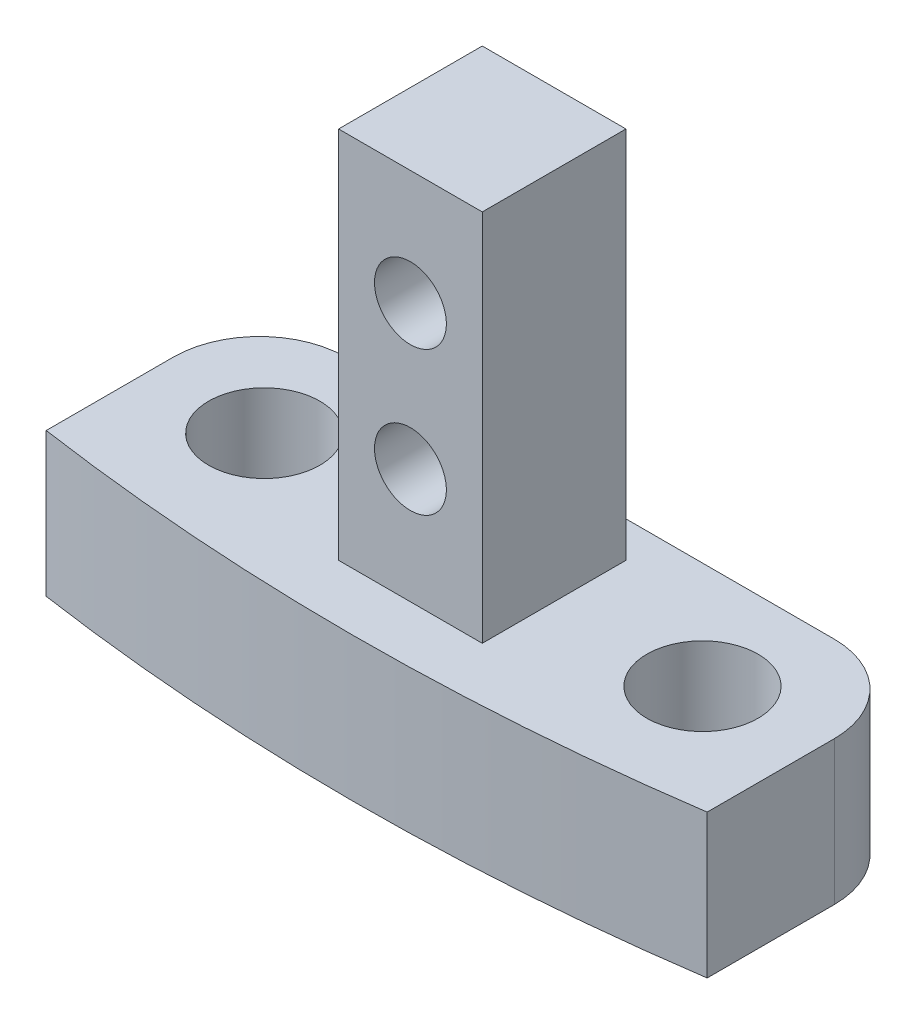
ISO-10303-21;
HEADER;
FILE_DESCRIPTION(('STEP AP214'),'2;1');
FILE_NAME('part.step','',(''),(''),'','','');
FILE_SCHEMA(('AUTOMOTIVE_DESIGN { 1 0 10303 214 1 1 1 1 }'));
ENDSEC;
DATA;
#1=APPLICATION_CONTEXT('core data for automotive mechanical design processes');
#2=APPLICATION_PROTOCOL_DEFINITION('international standard','automotive_design',2000,#1);
#3=PRODUCT_CONTEXT('',#1,'mechanical');
#4=PRODUCT('Part','Part','',(#3));
#5=PRODUCT_RELATED_PRODUCT_CATEGORY('part','',(#4));
#6=PRODUCT_DEFINITION_FORMATION('','',#4);
#7=PRODUCT_DEFINITION_CONTEXT('part definition',#1,'design');
#8=PRODUCT_DEFINITION('design','',#6,#7);
#9=PRODUCT_DEFINITION_SHAPE('','',#8);
#10=(LENGTH_UNIT() NAMED_UNIT(*) SI_UNIT(.MILLI.,.METRE.));
#11=(NAMED_UNIT(*) PLANE_ANGLE_UNIT() SI_UNIT($,.RADIAN.));
#12=(NAMED_UNIT(*) SI_UNIT($,.STERADIAN.) SOLID_ANGLE_UNIT());
#13=UNCERTAINTY_MEASURE_WITH_UNIT(LENGTH_MEASURE(1.E-05),#10,'distance_accuracy_value','');
#14=(GEOMETRIC_REPRESENTATION_CONTEXT(3) GLOBAL_UNCERTAINTY_ASSIGNED_CONTEXT((#13)) GLOBAL_UNIT_ASSIGNED_CONTEXT((#10,
#11,#12)) REPRESENTATION_CONTEXT('',''));
#15=CARTESIAN_POINT('',(0.,0.,0.));
#16=DIRECTION('',(0.,0.,1.));
#17=DIRECTION('',(1.,0.,0.));
#18=AXIS2_PLACEMENT_3D('',#15,#16,#17);
#19=CARTESIAN_POINT('',(0.,6.35,-79.1345216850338));
#20=DIRECTION('',(0.,-1.,0.));
#21=DIRECTION('',(0.,0.,-1.));
#22=AXIS2_PLACEMENT_3D('',#19,#20,#21);
#23=PLANE('',#22);
#24=CARTESIAN_POINT('',(9.68375,6.35,16.0671853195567));
#25=DIRECTION('',(0.,1.,0.));
#26=DIRECTION('',(0.,0.,1.));
#27=AXIS2_PLACEMENT_3D('',#24,#25,#26);
#28=CIRCLE('',#27,2.45744999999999);
#29=CARTESIAN_POINT('',(9.68375,6.35,18.5246353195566));
#30=VERTEX_POINT('',#29);
#31=EDGE_CURVE('E171',#30,#30,#28,.T.);
#32=ORIENTED_EDGE('',*,*,#31,.F.);
#33=EDGE_LOOP('',(#32));
#34=FACE_BOUND('',#33,.T.);
#35=CARTESIAN_POINT('',(-9.68375,6.35,16.0671853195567));
#36=DIRECTION('',(0.,1.,0.));
#37=DIRECTION('',(0.,0.,1.));
#38=AXIS2_PLACEMENT_3D('',#35,#36,#37);
#39=CIRCLE('',#38,2.45744999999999);
#40=CARTESIAN_POINT('',(-9.68375,6.35,18.5246353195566));
#41=VERTEX_POINT('',#40);
#42=EDGE_CURVE('E370',#41,#41,#39,.T.);
#43=ORIENTED_EDGE('',*,*,#42,.F.);
#44=EDGE_LOOP('',(#43));
#45=FACE_BOUND('',#44,.T.);
#46=DIRECTION('',(-1.,0.,0.));
#47=VECTOR('',#46,1.);
#48=CARTESIAN_POINT('',(-14.605,6.35,11.3529783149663));
#49=LINE('',#48,#47);
#50=CARTESIAN_POINT('',(10.795,6.35,11.3529783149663));
#51=VERTEX_POINT('',#50);
#52=CARTESIAN_POINT('',(-10.795,6.35,11.3529783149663));
#53=VERTEX_POINT('',#52);
#54=EDGE_CURVE('E153',#51,#53,#49,.T.);
#55=ORIENTED_EDGE('',*,*,#54,.T.);
#56=CARTESIAN_POINT('',(-10.795,6.35,15.1629783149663));
#57=DIRECTION('',(0.,-1.,0.));
#58=DIRECTION('',(0.,0.,-1.));
#59=AXIS2_PLACEMENT_3D('',#56,#57,#58);
#60=CIRCLE('',#59,3.81);
#61=CARTESIAN_POINT('',(-14.605,6.35,15.1629783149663));
#62=VERTEX_POINT('',#61);
#63=EDGE_CURVE('E43',#53,#62,#60,.F.);
#64=ORIENTED_EDGE('',*,*,#63,.T.);
#65=DIRECTION('',(0.,0.,1.));
#66=VECTOR('',#65,1.);
#67=CARTESIAN_POINT('',(-14.605,6.35,20.781392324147));
#68=LINE('',#67,#66);
#69=CARTESIAN_POINT('',(-14.605,6.35,20.781392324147));
#70=VERTEX_POINT('',#69);
#71=EDGE_CURVE('E155',#62,#70,#68,.T.);
#72=ORIENTED_EDGE('',*,*,#71,.T.);
#73=CARTESIAN_POINT('',(0.,6.35,-79.1345216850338));
#74=DIRECTION('',(0.,1.,0.));
#75=DIRECTION('',(0.,0.,-1.));
#76=AXIS2_PLACEMENT_3D('',#73,#74,#75);
#77=CIRCLE('',#76,100.9777);
#78=CARTESIAN_POINT('',(14.605,6.35,20.781392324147));
#79=VERTEX_POINT('',#78);
#80=EDGE_CURVE('E147',#70,#79,#77,.T.);
#81=ORIENTED_EDGE('',*,*,#80,.T.);
#82=DIRECTION('',(0.,0.,-1.));
#83=VECTOR('',#82,1.);
#84=CARTESIAN_POINT('',(14.605,6.35,11.3529783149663));
#85=LINE('',#84,#83);
#86=CARTESIAN_POINT('',(14.605,6.35,15.1629783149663));
#87=VERTEX_POINT('',#86);
#88=EDGE_CURVE('E150',#79,#87,#85,.T.);
#89=ORIENTED_EDGE('',*,*,#88,.T.);
#90=CARTESIAN_POINT('',(10.795,6.35,15.1629783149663));
#91=DIRECTION('',(0.,-1.,0.));
#92=DIRECTION('',(0.,0.,-1.));
#93=AXIS2_PLACEMENT_3D('',#90,#91,#92);
#94=CIRCLE('',#93,3.81);
#95=EDGE_CURVE('E187',#87,#51,#94,.F.);
#96=ORIENTED_EDGE('',*,*,#95,.T.);
#97=EDGE_LOOP('',(#55,#64,#72,#81,#89,#96));
#98=FACE_BOUND('',#97,.T.);
#99=DIRECTION('',(0.,0.,-1.));
#100=VECTOR('',#99,1.);
#101=CARTESIAN_POINT('',(3.175,6.35,19.2904783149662));
#102=LINE('',#101,#100);
#103=CARTESIAN_POINT('',(3.175,6.35,19.2904783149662));
#104=VERTEX_POINT('',#103);
#105=CARTESIAN_POINT('',(3.175,6.35,12.9404783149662));
#106=VERTEX_POINT('',#105);
#107=EDGE_CURVE('E137',#104,#106,#102,.T.);
#108=ORIENTED_EDGE('',*,*,#107,.F.);
#109=DIRECTION('',(1.,0.,0.));
#110=VECTOR('',#109,1.);
#111=CARTESIAN_POINT('',(-3.175,6.35,19.2904783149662));
#112=LINE('',#111,#110);
#113=CARTESIAN_POINT('',(-3.175,6.35,19.2904783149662));
#114=VERTEX_POINT('',#113);
#115=EDGE_CURVE('E134',#114,#104,#112,.T.);
#116=ORIENTED_EDGE('',*,*,#115,.F.);
#117=DIRECTION('',(0.,0.,1.));
#118=VECTOR('',#117,1.);
#119=CARTESIAN_POINT('',(-3.175,6.35,19.2904783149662));
#120=LINE('',#119,#118);
#121=CARTESIAN_POINT('',(-3.175,6.35,12.9404783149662));
#122=VERTEX_POINT('',#121);
#123=EDGE_CURVE('E382',#122,#114,#120,.T.);
#124=ORIENTED_EDGE('',*,*,#123,.F.);
#125=DIRECTION('',(-1.,0.,0.));
#126=VECTOR('',#125,1.);
#127=CARTESIAN_POINT('',(-3.175,6.35,12.9404783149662));
#128=LINE('',#127,#126);
#129=EDGE_CURVE('E372',#106,#122,#128,.T.);
#130=ORIENTED_EDGE('',*,*,#129,.F.);
#131=EDGE_LOOP('',(#108,#116,#124,#130));
#132=FACE_BOUND('',#131,.T.);
#133=ADVANCED_FACE('F35',(#34,#45,#98,#132),#23,.F.);
#134=CARTESIAN_POINT('',(0.,6.35,-79.1345216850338));
#135=DIRECTION('',(0.,-1.,0.));
#136=DIRECTION('',(0.,0.,-1.));
#137=AXIS2_PLACEMENT_3D('',#134,#135,#136);
#138=CYLINDRICAL_SURFACE('',#137,100.9777);
#139=CARTESIAN_POINT('',(0.,0.,-79.1345216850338));
#140=DIRECTION('',(0.,1.,0.));
#141=DIRECTION('',(0.,0.,-1.));
#142=AXIS2_PLACEMENT_3D('',#139,#140,#141);
#143=CIRCLE('',#142,100.9777);
#144=CARTESIAN_POINT('',(-14.605,0.,20.781392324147));
#145=VERTEX_POINT('',#144);
#146=CARTESIAN_POINT('',(14.605,0.,20.781392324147));
#147=VERTEX_POINT('',#146);
#148=EDGE_CURVE('E138',#145,#147,#143,.T.);
#149=ORIENTED_EDGE('',*,*,#148,.T.);
#150=DIRECTION('',(0.,-1.,0.));
#151=VECTOR('',#150,1.);
#152=CARTESIAN_POINT('',(14.605,6.35,20.781392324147));
#153=LINE('',#152,#151);
#154=EDGE_CURVE('E164',#79,#147,#153,.T.);
#155=ORIENTED_EDGE('',*,*,#154,.F.);
#156=ORIENTED_EDGE('',*,*,#80,.F.);
#157=DIRECTION('',(0.,-1.,0.));
#158=VECTOR('',#157,1.);
#159=CARTESIAN_POINT('',(-14.605,6.35,20.781392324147));
#160=LINE('',#159,#158);
#161=EDGE_CURVE('E156',#70,#145,#160,.T.);
#162=ORIENTED_EDGE('',*,*,#161,.T.);
#163=EDGE_LOOP('',(#149,#155,#156,#162));
#164=FACE_BOUND('',#163,.T.);
#165=ADVANCED_FACE('F211',(#164),#138,.T.);
#166=CARTESIAN_POINT('',(14.605,6.35,11.3529783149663));
#167=DIRECTION('',(-1.,0.,0.));
#168=DIRECTION('',(0.,0.,1.));
#169=AXIS2_PLACEMENT_3D('',#166,#167,#168);
#170=PLANE('',#169);
#171=DIRECTION('',(0.,0.,-1.));
#172=VECTOR('',#171,1.);
#173=CARTESIAN_POINT('',(14.605,0.,11.3529783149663));
#174=LINE('',#173,#172);
#175=CARTESIAN_POINT('',(14.605,0.,15.1629783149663));
#176=VERTEX_POINT('',#175);
#177=EDGE_CURVE('E141',#147,#176,#174,.T.);
#178=ORIENTED_EDGE('',*,*,#177,.T.);
#179=DIRECTION('',(0.,-1.,0.));
#180=VECTOR('',#179,1.);
#181=CARTESIAN_POINT('',(14.605,6.35,15.1629783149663));
#182=LINE('',#181,#180);
#183=EDGE_CURVE('E11',#176,#87,#182,.F.);
#184=ORIENTED_EDGE('',*,*,#183,.T.);
#185=ORIENTED_EDGE('',*,*,#88,.F.);
#186=ORIENTED_EDGE('',*,*,#154,.T.);
#187=EDGE_LOOP('',(#178,#184,#185,#186));
#188=FACE_BOUND('',#187,.T.);
#189=ADVANCED_FACE('F208',(#188),#170,.F.);
#190=CARTESIAN_POINT('',(-14.605,6.35,11.3529783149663));
#191=DIRECTION('',(0.,0.,1.));
#192=DIRECTION('',(1.,0.,0.));
#193=AXIS2_PLACEMENT_3D('',#190,#191,#192);
#194=PLANE('',#193);
#195=DIRECTION('',(-1.,0.,0.));
#196=VECTOR('',#195,1.);
#197=CARTESIAN_POINT('',(-14.605,0.,11.3529783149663));
#198=LINE('',#197,#196);
#199=CARTESIAN_POINT('',(10.795,0.,11.3529783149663));
#200=VERTEX_POINT('',#199);
#201=CARTESIAN_POINT('',(-10.795,0.,11.3529783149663));
#202=VERTEX_POINT('',#201);
#203=EDGE_CURVE('E159',#200,#202,#198,.T.);
#204=ORIENTED_EDGE('',*,*,#203,.T.);
#205=DIRECTION('',(0.,-1.,0.));
#206=VECTOR('',#205,1.);
#207=CARTESIAN_POINT('',(-10.795,6.35,11.3529783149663));
#208=LINE('',#207,#206);
#209=EDGE_CURVE('E56',#202,#53,#208,.F.);
#210=ORIENTED_EDGE('',*,*,#209,.T.);
#211=ORIENTED_EDGE('',*,*,#54,.F.);
#212=DIRECTION('',(0.,-1.,0.));
#213=VECTOR('',#212,1.);
#214=CARTESIAN_POINT('',(10.795,6.35,11.3529783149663));
#215=LINE('',#214,#213);
#216=EDGE_CURVE('E183',#51,#200,#215,.T.);
#217=ORIENTED_EDGE('',*,*,#216,.T.);
#218=EDGE_LOOP('',(#204,#210,#211,#217));
#219=FACE_BOUND('',#218,.T.);
#220=ADVANCED_FACE('F204',(#219),#194,.F.);
#221=CARTESIAN_POINT('',(-14.605,6.35,20.781392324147));
#222=DIRECTION('',(1.,0.,0.));
#223=DIRECTION('',(0.,0.,-1.));
#224=AXIS2_PLACEMENT_3D('',#221,#222,#223);
#225=PLANE('',#224);
#226=ORIENTED_EDGE('',*,*,#71,.F.);
#227=DIRECTION('',(0.,-1.,0.));
#228=VECTOR('',#227,1.);
#229=CARTESIAN_POINT('',(-14.605,6.35,15.1629783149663));
#230=LINE('',#229,#228);
#231=CARTESIAN_POINT('',(-14.605,0.,15.1629783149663));
#232=VERTEX_POINT('',#231);
#233=EDGE_CURVE('E167',#62,#232,#230,.T.);
#234=ORIENTED_EDGE('',*,*,#233,.T.);
#235=DIRECTION('',(0.,0.,1.));
#236=VECTOR('',#235,1.);
#237=CARTESIAN_POINT('',(-14.605,0.,20.781392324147));
#238=LINE('',#237,#236);
#239=EDGE_CURVE('E151',#232,#145,#238,.T.);
#240=ORIENTED_EDGE('',*,*,#239,.T.);
#241=ORIENTED_EDGE('',*,*,#161,.F.);
#242=EDGE_LOOP('',(#226,#234,#240,#241));
#243=FACE_BOUND('',#242,.T.);
#244=ADVANCED_FACE('F196',(#243),#225,.F.);
#245=CARTESIAN_POINT('',(0.,0.,-79.1345216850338));
#246=DIRECTION('',(0.,-1.,0.));
#247=DIRECTION('',(0.,0.,-1.));
#248=AXIS2_PLACEMENT_3D('',#245,#246,#247);
#249=PLANE('',#248);
#250=CARTESIAN_POINT('',(9.68375,0.,16.0671853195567));
#251=DIRECTION('',(0.,1.,0.));
#252=DIRECTION('',(0.,0.,1.));
#253=AXIS2_PLACEMENT_3D('',#250,#251,#252);
#254=CIRCLE('',#253,2.45745);
#255=CARTESIAN_POINT('',(9.68375,0.,18.5246353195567));
#256=VERTEX_POINT('',#255);
#257=EDGE_CURVE('E366',#256,#256,#254,.T.);
#258=ORIENTED_EDGE('',*,*,#257,.T.);
#259=EDGE_LOOP('',(#258));
#260=FACE_BOUND('',#259,.T.);
#261=CARTESIAN_POINT('',(-9.68375,0.,16.0671853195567));
#262=DIRECTION('',(0.,1.,0.));
#263=DIRECTION('',(0.,0.,1.));
#264=AXIS2_PLACEMENT_3D('',#261,#262,#263);
#265=CIRCLE('',#264,2.45745);
#266=CARTESIAN_POINT('',(-9.68375,0.,18.5246353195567));
#267=VERTEX_POINT('',#266);
#268=EDGE_CURVE('E369',#267,#267,#265,.T.);
#269=ORIENTED_EDGE('',*,*,#268,.T.);
#270=EDGE_LOOP('',(#269));
#271=FACE_BOUND('',#270,.T.);
#272=ORIENTED_EDGE('',*,*,#239,.F.);
#273=CARTESIAN_POINT('',(-10.795,0.,15.1629783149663));
#274=DIRECTION('',(0.,-1.,0.));
#275=DIRECTION('',(0.,0.,-1.));
#276=AXIS2_PLACEMENT_3D('',#273,#274,#275);
#277=CIRCLE('',#276,3.81);
#278=EDGE_CURVE('E181',#232,#202,#277,.T.);
#279=ORIENTED_EDGE('',*,*,#278,.T.);
#280=ORIENTED_EDGE('',*,*,#203,.F.);
#281=CARTESIAN_POINT('',(10.795,0.,15.1629783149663));
#282=DIRECTION('',(0.,-1.,0.));
#283=DIRECTION('',(0.,0.,-1.));
#284=AXIS2_PLACEMENT_3D('',#281,#282,#283);
#285=CIRCLE('',#284,3.81);
#286=EDGE_CURVE('E179',#200,#176,#285,.T.);
#287=ORIENTED_EDGE('',*,*,#286,.T.);
#288=ORIENTED_EDGE('',*,*,#177,.F.);
#289=ORIENTED_EDGE('',*,*,#148,.F.);
#290=EDGE_LOOP('',(#272,#279,#280,#287,#288,#289));
#291=FACE_BOUND('',#290,.T.);
#292=ADVANCED_FACE('F202',(#260,#271,#291),#249,.T.);
#293=CARTESIAN_POINT('',(3.175,22.86,19.2904783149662));
#294=DIRECTION('',(-1.,0.,0.));
#295=DIRECTION('',(0.,0.,1.));
#296=AXIS2_PLACEMENT_3D('',#293,#294,#295);
#297=PLANE('',#296);
#298=ORIENTED_EDGE('',*,*,#107,.T.);
#299=DIRECTION('',(0.,-1.,0.));
#300=VECTOR('',#299,1.);
#301=CARTESIAN_POINT('',(3.175,22.86,12.9404783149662));
#302=LINE('',#301,#300);
#303=CARTESIAN_POINT('',(3.175,22.86,12.9404783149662));
#304=VERTEX_POINT('',#303);
#305=EDGE_CURVE('E118',#304,#106,#302,.T.);
#306=ORIENTED_EDGE('',*,*,#305,.F.);
#307=DIRECTION('',(0.,0.,-1.));
#308=VECTOR('',#307,1.);
#309=CARTESIAN_POINT('',(3.175,22.86,19.2904783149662));
#310=LINE('',#309,#308);
#311=CARTESIAN_POINT('',(3.175,22.86,19.2904783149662));
#312=VERTEX_POINT('',#311);
#313=EDGE_CURVE('E125',#312,#304,#310,.T.);
#314=ORIENTED_EDGE('',*,*,#313,.F.);
#315=DIRECTION('',(0.,-1.,0.));
#316=VECTOR('',#315,1.);
#317=CARTESIAN_POINT('',(3.175,22.86,19.2904783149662));
#318=LINE('',#317,#316);
#319=EDGE_CURVE('E379',#312,#104,#318,.T.);
#320=ORIENTED_EDGE('',*,*,#319,.T.);
#321=EDGE_LOOP('',(#298,#306,#314,#320));
#322=FACE_BOUND('',#321,.T.);
#323=ADVANCED_FACE('F136',(#322),#297,.F.);
#324=CARTESIAN_POINT('',(-3.175,22.86,12.9404783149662));
#325=DIRECTION('',(0.,0.,1.));
#326=DIRECTION('',(1.,0.,0.));
#327=AXIS2_PLACEMENT_3D('',#324,#325,#326);
#328=PLANE('',#327);
#329=CARTESIAN_POINT('',(0.,17.78,12.9404783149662));
#330=DIRECTION('',(0.,0.,-1.));
#331=DIRECTION('',(-1.,0.,0.));
#332=AXIS2_PLACEMENT_3D('',#329,#330,#331);
#333=CIRCLE('',#332,1.5875);
#334=CARTESIAN_POINT('',(-1.5875,17.78,12.9404783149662));
#335=VERTEX_POINT('',#334);
#336=EDGE_CURVE('E176',#335,#335,#333,.T.);
#337=ORIENTED_EDGE('',*,*,#336,.F.);
#338=EDGE_LOOP('',(#337));
#339=FACE_BOUND('',#338,.T.);
#340=CARTESIAN_POINT('',(0.,11.43,12.9404783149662));
#341=DIRECTION('',(0.,0.,-1.));
#342=DIRECTION('',(-1.,0.,0.));
#343=AXIS2_PLACEMENT_3D('',#340,#341,#342);
#344=CIRCLE('',#343,1.5875);
#345=CARTESIAN_POINT('',(-1.5875,11.43,12.9404783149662));
#346=VERTEX_POINT('',#345);
#347=EDGE_CURVE('E172',#346,#346,#344,.T.);
#348=ORIENTED_EDGE('',*,*,#347,.F.);
#349=EDGE_LOOP('',(#348));
#350=FACE_BOUND('',#349,.T.);
#351=ORIENTED_EDGE('',*,*,#129,.T.);
#352=DIRECTION('',(0.,-1.,0.));
#353=VECTOR('',#352,1.);
#354=CARTESIAN_POINT('',(-3.175,22.86,12.9404783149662));
#355=LINE('',#354,#353);
#356=CARTESIAN_POINT('',(-3.175,22.86,12.9404783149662));
#357=VERTEX_POINT('',#356);
#358=EDGE_CURVE('E121',#357,#122,#355,.T.);
#359=ORIENTED_EDGE('',*,*,#358,.F.);
#360=DIRECTION('',(-1.,0.,0.));
#361=VECTOR('',#360,1.);
#362=CARTESIAN_POINT('',(-3.175,22.86,12.9404783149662));
#363=LINE('',#362,#361);
#364=EDGE_CURVE('E113',#304,#357,#363,.T.);
#365=ORIENTED_EDGE('',*,*,#364,.F.);
#366=ORIENTED_EDGE('',*,*,#305,.T.);
#367=EDGE_LOOP('',(#351,#359,#365,#366));
#368=FACE_BOUND('',#367,.T.);
#369=ADVANCED_FACE('F116',(#339,#350,#368),#328,.F.);
#370=CARTESIAN_POINT('',(-3.175,22.86,19.2904783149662));
#371=DIRECTION('',(1.,0.,0.));
#372=DIRECTION('',(0.,0.,-1.));
#373=AXIS2_PLACEMENT_3D('',#370,#371,#372);
#374=PLANE('',#373);
#375=ORIENTED_EDGE('',*,*,#123,.T.);
#376=DIRECTION('',(0.,-1.,0.));
#377=VECTOR('',#376,1.);
#378=CARTESIAN_POINT('',(-3.175,22.86,19.2904783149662));
#379=LINE('',#378,#377);
#380=CARTESIAN_POINT('',(-3.175,22.86,19.2904783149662));
#381=VERTEX_POINT('',#380);
#382=EDGE_CURVE('E143',#381,#114,#379,.T.);
#383=ORIENTED_EDGE('',*,*,#382,.F.);
#384=DIRECTION('',(0.,0.,1.));
#385=VECTOR('',#384,1.);
#386=CARTESIAN_POINT('',(-3.175,22.86,19.2904783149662));
#387=LINE('',#386,#385);
#388=EDGE_CURVE('E124',#357,#381,#387,.T.);
#389=ORIENTED_EDGE('',*,*,#388,.F.);
#390=ORIENTED_EDGE('',*,*,#358,.T.);
#391=EDGE_LOOP('',(#375,#383,#389,#390));
#392=FACE_BOUND('',#391,.T.);
#393=ADVANCED_FACE('F252',(#392),#374,.F.);
#394=CARTESIAN_POINT('',(-3.175,22.86,19.2904783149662));
#395=DIRECTION('',(0.,0.,-1.));
#396=DIRECTION('',(-1.,0.,0.));
#397=AXIS2_PLACEMENT_3D('',#394,#395,#396);
#398=PLANE('',#397);
#399=CARTESIAN_POINT('',(0.,17.78,19.2904783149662));
#400=DIRECTION('',(0.,0.,-1.));
#401=DIRECTION('',(-1.,0.,0.));
#402=AXIS2_PLACEMENT_3D('',#399,#400,#401);
#403=CIRCLE('',#402,1.5875);
#404=CARTESIAN_POINT('',(-1.5875,17.78,19.2904783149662));
#405=VERTEX_POINT('',#404);
#406=EDGE_CURVE('E173',#405,#405,#403,.T.);
#407=ORIENTED_EDGE('',*,*,#406,.T.);
#408=EDGE_LOOP('',(#407));
#409=FACE_BOUND('',#408,.T.);
#410=CARTESIAN_POINT('',(0.,11.43,19.2904783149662));
#411=DIRECTION('',(0.,0.,-1.));
#412=DIRECTION('',(-1.,0.,0.));
#413=AXIS2_PLACEMENT_3D('',#410,#411,#412);
#414=CIRCLE('',#413,1.5875);
#415=CARTESIAN_POINT('',(-1.5875,11.43,19.2904783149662));
#416=VERTEX_POINT('',#415);
#417=EDGE_CURVE('E168',#416,#416,#414,.T.);
#418=ORIENTED_EDGE('',*,*,#417,.T.);
#419=EDGE_LOOP('',(#418));
#420=FACE_BOUND('',#419,.T.);
#421=ORIENTED_EDGE('',*,*,#115,.T.);
#422=ORIENTED_EDGE('',*,*,#319,.F.);
#423=DIRECTION('',(1.,0.,0.));
#424=VECTOR('',#423,1.);
#425=CARTESIAN_POINT('',(-3.175,22.86,19.2904783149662));
#426=LINE('',#425,#424);
#427=EDGE_CURVE('E130',#381,#312,#426,.T.);
#428=ORIENTED_EDGE('',*,*,#427,.F.);
#429=ORIENTED_EDGE('',*,*,#382,.T.);
#430=EDGE_LOOP('',(#421,#422,#428,#429));
#431=FACE_BOUND('',#430,.T.);
#432=ADVANCED_FACE('F249',(#409,#420,#431),#398,.F.);
#433=CARTESIAN_POINT('',(0.,22.86,0.));
#434=DIRECTION('',(0.,-1.,0.));
#435=DIRECTION('',(0.,0.,-1.));
#436=AXIS2_PLACEMENT_3D('',#433,#434,#435);
#437=PLANE('',#436);
#438=ORIENTED_EDGE('',*,*,#313,.T.);
#439=ORIENTED_EDGE('',*,*,#364,.T.);
#440=ORIENTED_EDGE('',*,*,#388,.T.);
#441=ORIENTED_EDGE('',*,*,#427,.T.);
#442=EDGE_LOOP('',(#438,#439,#440,#441));
#443=FACE_BOUND('',#442,.T.);
#444=ADVANCED_FACE('F128',(#443),#437,.F.);
#445=CARTESIAN_POINT('',(-9.68375,6.35,16.0671853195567));
#446=DIRECTION('',(0.,1.,0.));
#447=DIRECTION('',(0.,0.,1.));
#448=AXIS2_PLACEMENT_3D('',#445,#446,#447);
#449=CYLINDRICAL_SURFACE('',#448,2.45744999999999);
#450=ORIENTED_EDGE('',*,*,#268,.F.);
#451=EDGE_LOOP('',(#450));
#452=FACE_BOUND('',#451,.T.);
#453=ORIENTED_EDGE('',*,*,#42,.T.);
#454=EDGE_LOOP('',(#453));
#455=FACE_BOUND('',#454,.T.);
#456=ADVANCED_FACE('F242',(#452,#455),#449,.F.);
#457=CARTESIAN_POINT('',(9.68375,6.35,16.0671853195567));
#458=DIRECTION('',(0.,1.,0.));
#459=DIRECTION('',(0.,0.,1.));
#460=AXIS2_PLACEMENT_3D('',#457,#458,#459);
#461=CYLINDRICAL_SURFACE('',#460,2.45744999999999);
#462=ORIENTED_EDGE('',*,*,#257,.F.);
#463=EDGE_LOOP('',(#462));
#464=FACE_BOUND('',#463,.T.);
#465=ORIENTED_EDGE('',*,*,#31,.T.);
#466=EDGE_LOOP('',(#465));
#467=FACE_BOUND('',#466,.T.);
#468=ADVANCED_FACE('F234',(#464,#467),#461,.F.);
#469=CARTESIAN_POINT('',(0.,11.43,12.9404783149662));
#470=DIRECTION('',(0.,0.,-1.));
#471=DIRECTION('',(-1.,0.,0.));
#472=AXIS2_PLACEMENT_3D('',#469,#470,#471);
#473=CYLINDRICAL_SURFACE('',#472,1.5875);
#474=ORIENTED_EDGE('',*,*,#347,.T.);
#475=EDGE_LOOP('',(#474));
#476=FACE_BOUND('',#475,.T.);
#477=ORIENTED_EDGE('',*,*,#417,.F.);
#478=EDGE_LOOP('',(#477));
#479=FACE_BOUND('',#478,.T.);
#480=ADVANCED_FACE('F228',(#476,#479),#473,.F.);
#481=CARTESIAN_POINT('',(0.,17.78,12.9404783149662));
#482=DIRECTION('',(0.,0.,-1.));
#483=DIRECTION('',(-1.,0.,0.));
#484=AXIS2_PLACEMENT_3D('',#481,#482,#483);
#485=CYLINDRICAL_SURFACE('',#484,1.5875);
#486=ORIENTED_EDGE('',*,*,#336,.T.);
#487=EDGE_LOOP('',(#486));
#488=FACE_BOUND('',#487,.T.);
#489=ORIENTED_EDGE('',*,*,#406,.F.);
#490=EDGE_LOOP('',(#489));
#491=FACE_BOUND('',#490,.T.);
#492=ADVANCED_FACE('F223',(#488,#491),#485,.F.);
#493=CARTESIAN_POINT('',(-10.795,6.35,15.1629783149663));
#494=DIRECTION('',(0.,-1.,0.));
#495=DIRECTION('',(0.,0.,-1.));
#496=AXIS2_PLACEMENT_3D('',#493,#494,#495);
#497=CYLINDRICAL_SURFACE('',#496,3.81);
#498=ORIENTED_EDGE('',*,*,#63,.F.);
#499=ORIENTED_EDGE('',*,*,#209,.F.);
#500=ORIENTED_EDGE('',*,*,#278,.F.);
#501=ORIENTED_EDGE('',*,*,#233,.F.);
#502=EDGE_LOOP('',(#498,#499,#500,#501));
#503=FACE_BOUND('',#502,.T.);
#504=ADVANCED_FACE('F199',(#503),#497,.T.);
#505=CARTESIAN_POINT('',(10.795,6.35,15.1629783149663));
#506=DIRECTION('',(0.,-1.,0.));
#507=DIRECTION('',(0.,0.,-1.));
#508=AXIS2_PLACEMENT_3D('',#505,#506,#507);
#509=CYLINDRICAL_SURFACE('',#508,3.81);
#510=ORIENTED_EDGE('',*,*,#95,.F.);
#511=ORIENTED_EDGE('',*,*,#183,.F.);
#512=ORIENTED_EDGE('',*,*,#286,.F.);
#513=ORIENTED_EDGE('',*,*,#216,.F.);
#514=EDGE_LOOP('',(#510,#511,#512,#513));
#515=FACE_BOUND('',#514,.T.);
#516=ADVANCED_FACE('F37',(#515),#509,.T.);
#517=CLOSED_SHELL('',(#133,#165,#189,#220,#244,#292,#323,#369,#393,#432,#444,#456,#468,#480,
#492,#504,#516));
#518=MANIFOLD_SOLID_BREP('B2',#517);
#519=ADVANCED_BREP_SHAPE_REPRESENTATION('',(#18,#518),#14);
#520=SHAPE_DEFINITION_REPRESENTATION(#9,#519);
ENDSEC;
END-ISO-10303-21;
